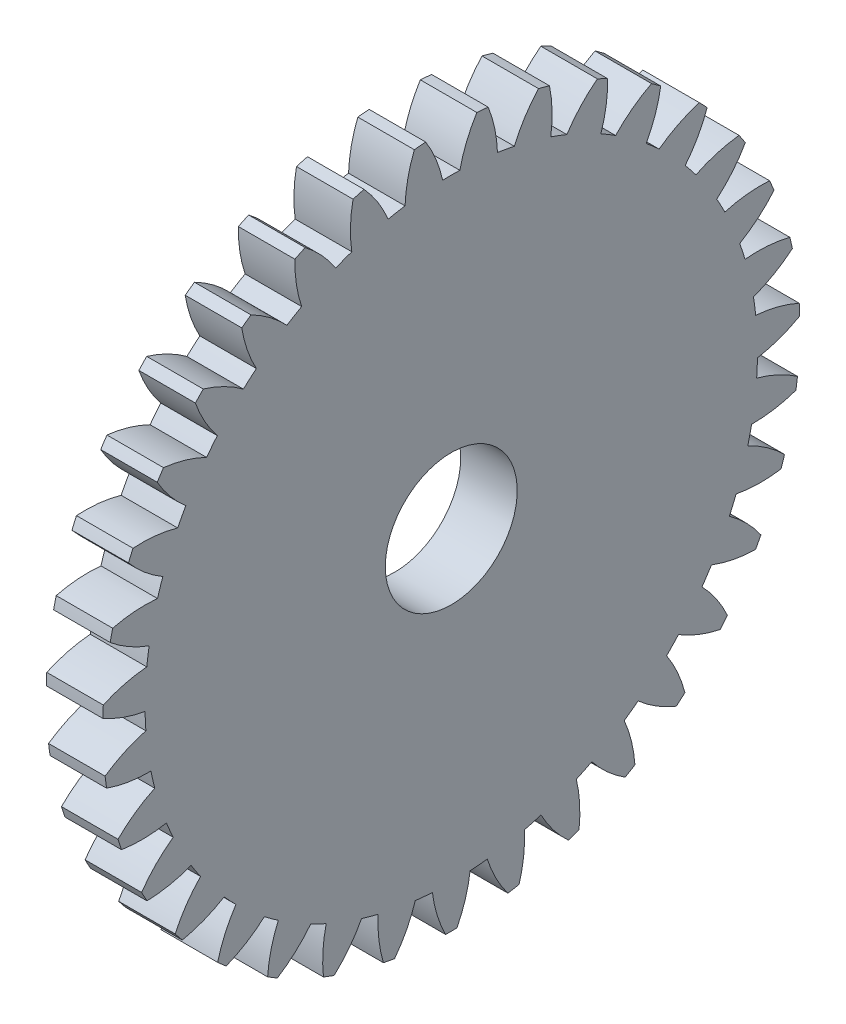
from build123d import *

# Parameters (mm, degrees)
BASPROSKE_W     = 3
BASPROSKE_H     = 18.5
TOOTHCUT_DEPTH  = 27.334388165
TEETHCUTS_COUNT = 35
TEETHCUTS_ANGLE = 349.714285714
BORSKE_R        = 3.5
BORE_DEPTH      = 50.0000508


with BuildPart() as part:
    # BasProSke → Base-Revolve (revolve)
    with BuildSketch(Plane(origin=(0, 0, 0), x_dir=(1, 0, 0), z_dir=(0, 1, 0)), mode=Mode.PRIVATE) as base_revolve_sk:
        with Locations((1.5, 9.25)):
            Rectangle(BASPROSKE_W, BASPROSKE_H)
    revolve(base_revolve_sk.sketch.rotate(Axis((-10, 0, 0), (1, 0, 0)), 180), axis=Axis((-10, 0, 0), (1, 0, 0)))

    # TooCutSke → ToothCut (cut, through all)
    with BuildSketch(Plane(origin=(0, 0, 0), x_dir=(0, 0, -1), z_dir=(1, 0, 0))):
        with BuildLine():
            ThreePointArc((0.456361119, 16.242590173), (0, 16.249), (-0.456361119, 16.242590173))
            ThreePointArc((-0.456361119, 16.242590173), (-0.817781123, 17.39831105), (-1.372969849, 18.474452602))
            ThreePointArc((-1.372969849, 18.474452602), (0, 18.5254), (1.372969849, 18.474452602))
            ThreePointArc((1.372969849, 18.474452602), (0.817781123, 17.39831105), (0.456361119, 16.242590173))
        make_face()
    toothcut = extrude(amount=TOOTHCUT_DEPTH, mode=Mode.SUBTRACT)

    # TeethCuts: ToothCut ×35 about axis
    teethcuts_axis = Axis((-10, 0, 0), (1, 0, 0))
    for i in range(1, TEETHCUTS_COUNT):
        add(toothcut.rotate(teethcuts_axis, i * TEETHCUTS_ANGLE / (TEETHCUTS_COUNT - 1)), mode=Mode.SUBTRACT)

    # BorSke → Bore (cut, symmetric)
    with BuildSketch(Plane(origin=(0, 0, 0), x_dir=(0, 0, -1), z_dir=(1, 0, 0))):
        with Locations(Location((0, 0, 0), (0, 0, 180))):
            Circle(BORSKE_R)
    extrude(amount=BORE_DEPTH, both=True, mode=Mode.SUBTRACT)


solid = part.part
